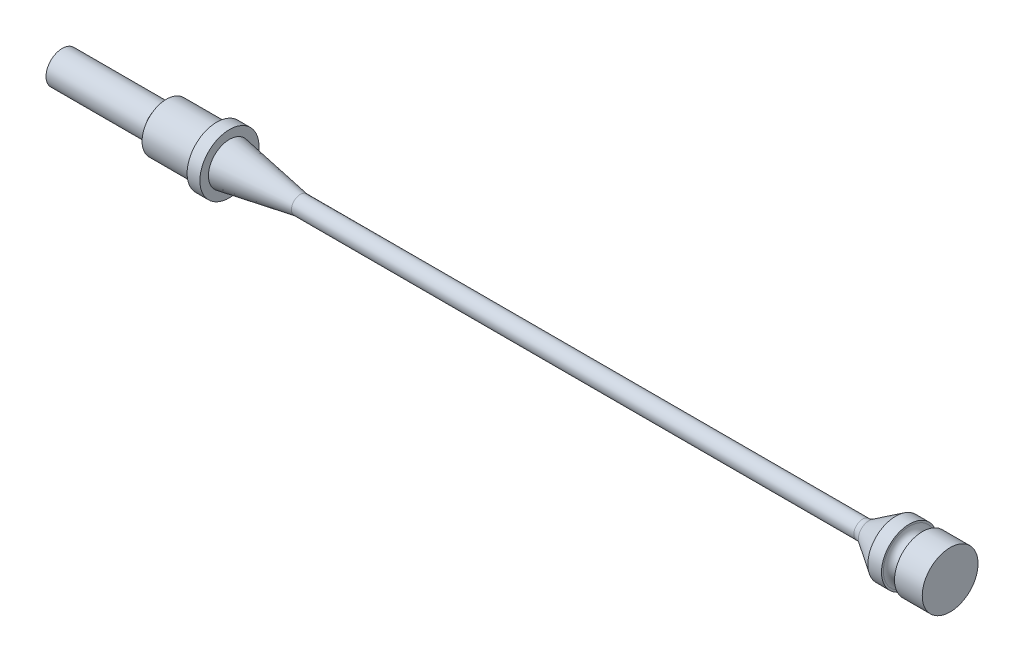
ISO-10303-21;
HEADER;
FILE_DESCRIPTION(('STEP AP214'),'2;1');
FILE_NAME('part.step','',(''),(''),'','','');
FILE_SCHEMA(('AUTOMOTIVE_DESIGN { 1 0 10303 214 1 1 1 1 }'));
ENDSEC;
DATA;
#1=APPLICATION_CONTEXT('core data for automotive mechanical design processes');
#2=APPLICATION_PROTOCOL_DEFINITION('international standard','automotive_design',2000,#1);
#3=PRODUCT_CONTEXT('',#1,'mechanical');
#4=PRODUCT('Part','Part','',(#3));
#5=PRODUCT_RELATED_PRODUCT_CATEGORY('part','',(#4));
#6=PRODUCT_DEFINITION_FORMATION('','',#4);
#7=PRODUCT_DEFINITION_CONTEXT('part definition',#1,'design');
#8=PRODUCT_DEFINITION('design','',#6,#7);
#9=PRODUCT_DEFINITION_SHAPE('','',#8);
#10=(LENGTH_UNIT() NAMED_UNIT(*) SI_UNIT(.MILLI.,.METRE.));
#11=(NAMED_UNIT(*) PLANE_ANGLE_UNIT() SI_UNIT($,.RADIAN.));
#12=(NAMED_UNIT(*) SI_UNIT($,.STERADIAN.) SOLID_ANGLE_UNIT());
#13=UNCERTAINTY_MEASURE_WITH_UNIT(LENGTH_MEASURE(1.E-05),#10,'distance_accuracy_value','');
#14=(GEOMETRIC_REPRESENTATION_CONTEXT(3) GLOBAL_UNCERTAINTY_ASSIGNED_CONTEXT((#13)) GLOBAL_UNIT_ASSIGNED_CONTEXT((#10,
#11,#12)) REPRESENTATION_CONTEXT('',''));
#15=CARTESIAN_POINT('',(0.,0.,0.));
#16=DIRECTION('',(0.,0.,1.));
#17=DIRECTION('',(1.,0.,0.));
#18=AXIS2_PLACEMENT_3D('',#15,#16,#17);
#19=CARTESIAN_POINT('',(190.5,0.,0.));
#20=DIRECTION('',(-1.,0.,0.));
#21=DIRECTION('',(0.,0.,1.));
#22=AXIS2_PLACEMENT_3D('',#19,#20,#21);
#23=PLANE('',#22);
#24=CARTESIAN_POINT('',(190.5,0.,0.));
#25=DIRECTION('',(-1.,0.,0.));
#26=DIRECTION('',(0.,0.,1.));
#27=AXIS2_PLACEMENT_3D('',#24,#25,#26);
#28=CIRCLE('',#27,5.98805);
#29=CARTESIAN_POINT('',(190.5,0.,5.98805));
#30=VERTEX_POINT('',#29);
#31=EDGE_CURVE('E10',#30,#30,#28,.T.);
#32=ORIENTED_EDGE('',*,*,#31,.F.);
#33=EDGE_LOOP('',(#32));
#34=FACE_BOUND('',#33,.T.);
#35=ADVANCED_FACE('F30',(#34),#23,.F.);
#36=CARTESIAN_POINT('',(0.,0.,0.));
#37=DIRECTION('',(-1.,0.,0.));
#38=DIRECTION('',(0.,0.,1.));
#39=AXIS2_PLACEMENT_3D('',#36,#37,#38);
#40=CYLINDRICAL_SURFACE('',#39,5.98805);
#41=CARTESIAN_POINT('',(184.5564,0.,0.));
#42=DIRECTION('',(-1.,0.,0.));
#43=DIRECTION('',(0.,0.,1.));
#44=AXIS2_PLACEMENT_3D('',#41,#42,#43);
#45=CIRCLE('',#44,5.98805);
#46=CARTESIAN_POINT('',(184.5564,0.,5.98805));
#47=VERTEX_POINT('',#46);
#48=EDGE_CURVE('E36',#47,#47,#45,.T.);
#49=ORIENTED_EDGE('',*,*,#48,.F.);
#50=EDGE_LOOP('',(#49));
#51=FACE_BOUND('',#50,.T.);
#52=ORIENTED_EDGE('',*,*,#31,.T.);
#53=EDGE_LOOP('',(#52));
#54=FACE_BOUND('',#53,.T.);
#55=ADVANCED_FACE('F168',(#51,#54),#40,.T.);
#56=CARTESIAN_POINT('',(184.5564,5.98805,0.));
#57=DIRECTION('',(1.,0.,0.));
#58=DIRECTION('',(0.,0.,-1.));
#59=AXIS2_PLACEMENT_3D('',#56,#57,#58);
#60=PLANE('',#59);
#61=CARTESIAN_POINT('',(184.5564,0.,0.));
#62=DIRECTION('',(-1.,0.,0.));
#63=DIRECTION('',(0.,0.,1.));
#64=AXIS2_PLACEMENT_3D('',#61,#62,#63);
#65=CIRCLE('',#64,5.588);
#66=CARTESIAN_POINT('',(184.5564,0.,5.588));
#67=VERTEX_POINT('',#66);
#68=EDGE_CURVE('E40',#67,#67,#65,.T.);
#69=ORIENTED_EDGE('',*,*,#68,.F.);
#70=EDGE_LOOP('',(#69));
#71=FACE_BOUND('',#70,.T.);
#72=ORIENTED_EDGE('',*,*,#48,.T.);
#73=EDGE_LOOP('',(#72));
#74=FACE_BOUND('',#73,.T.);
#75=ADVANCED_FACE('F163',(#71,#74),#60,.F.);
#76=CARTESIAN_POINT('',(183.1594,0.,0.));
#77=DIRECTION('',(-1.,0.,0.));
#78=DIRECTION('',(0.,0.,1.));
#79=AXIS2_PLACEMENT_3D('',#76,#77,#78);
#80=TOROIDAL_SURFACE('',#79,5.588,1.397);
#81=CARTESIAN_POINT('',(181.7624,0.,0.));
#82=DIRECTION('',(-1.,0.,0.));
#83=DIRECTION('',(0.,0.,1.));
#84=AXIS2_PLACEMENT_3D('',#81,#82,#83);
#85=CIRCLE('',#84,5.588);
#86=CARTESIAN_POINT('',(181.7624,0.,5.588));
#87=VERTEX_POINT('',#86);
#88=EDGE_CURVE('E44',#87,#87,#85,.T.);
#89=ORIENTED_EDGE('',*,*,#88,.F.);
#90=EDGE_LOOP('',(#89));
#91=FACE_BOUND('',#90,.T.);
#92=ORIENTED_EDGE('',*,*,#68,.T.);
#93=EDGE_LOOP('',(#92));
#94=FACE_BOUND('',#93,.T.);
#95=ADVANCED_FACE('F157',(#91,#94),#80,.F.);
#96=CARTESIAN_POINT('',(181.7624,5.588,0.));
#97=DIRECTION('',(-1.,0.,0.));
#98=DIRECTION('',(0.,0.,1.));
#99=AXIS2_PLACEMENT_3D('',#96,#97,#98);
#100=PLANE('',#99);
#101=CARTESIAN_POINT('',(181.7624,0.,0.));
#102=DIRECTION('',(-1.,0.,0.));
#103=DIRECTION('',(0.,0.,1.));
#104=AXIS2_PLACEMENT_3D('',#101,#102,#103);
#105=CIRCLE('',#104,5.98805);
#106=CARTESIAN_POINT('',(181.7624,0.,5.98805));
#107=VERTEX_POINT('',#106);
#108=EDGE_CURVE('E49',#107,#107,#105,.T.);
#109=ORIENTED_EDGE('',*,*,#108,.F.);
#110=EDGE_LOOP('',(#109));
#111=FACE_BOUND('',#110,.T.);
#112=ORIENTED_EDGE('',*,*,#88,.T.);
#113=EDGE_LOOP('',(#112));
#114=FACE_BOUND('',#113,.T.);
#115=ADVANCED_FACE('F151',(#111,#114),#100,.F.);
#116=CARTESIAN_POINT('',(0.,0.,0.));
#117=DIRECTION('',(-1.,0.,0.));
#118=DIRECTION('',(0.,0.,1.));
#119=AXIS2_PLACEMENT_3D('',#116,#117,#118);
#120=CYLINDRICAL_SURFACE('',#119,5.98805);
#121=CARTESIAN_POINT('',(178.8287,0.,0.));
#122=DIRECTION('',(-1.,0.,0.));
#123=DIRECTION('',(0.,0.,1.));
#124=AXIS2_PLACEMENT_3D('',#121,#122,#123);
#125=CIRCLE('',#124,5.98805);
#126=CARTESIAN_POINT('',(178.8287,0.,5.98805));
#127=VERTEX_POINT('',#126);
#128=EDGE_CURVE('E52',#127,#127,#125,.T.);
#129=ORIENTED_EDGE('',*,*,#128,.F.);
#130=EDGE_LOOP('',(#129));
#131=FACE_BOUND('',#130,.T.);
#132=ORIENTED_EDGE('',*,*,#108,.T.);
#133=EDGE_LOOP('',(#132));
#134=FACE_BOUND('',#133,.T.);
#135=ADVANCED_FACE('F145',(#131,#134),#120,.T.);
#136=CARTESIAN_POINT('',(178.8287,0.,0.));
#137=DIRECTION('',(1.,0.,0.));
#138=DIRECTION('',(0.,0.,-1.));
#139=AXIS2_PLACEMENT_3D('',#136,#137,#138);
#140=CONICAL_SURFACE('',#139,5.98805,0.571438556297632);
#141=CARTESIAN_POINT('',(173.106298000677,0.,0.));
#142=DIRECTION('',(-1.,0.,0.));
#143=DIRECTION('',(0.,0.,1.));
#144=AXIS2_PLACEMENT_3D('',#141,#142,#143);
#145=CIRCLE('',#144,2.30854551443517);
#146=CARTESIAN_POINT('',(173.106298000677,0.,2.30854551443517));
#147=VERTEX_POINT('',#146);
#148=EDGE_CURVE('E55',#147,#147,#145,.T.);
#149=ORIENTED_EDGE('',*,*,#148,.F.);
#150=EDGE_LOOP('',(#149));
#151=FACE_BOUND('',#150,.T.);
#152=ORIENTED_EDGE('',*,*,#128,.T.);
#153=EDGE_LOOP('',(#152));
#154=FACE_BOUND('',#153,.T.);
#155=ADVANCED_FACE('F139',(#151,#154),#140,.T.);
#156=CARTESIAN_POINT('',(171.732557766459,0.,0.));
#157=DIRECTION('',(-1.,0.,0.));
#158=DIRECTION('',(0.,0.,1.));
#159=AXIS2_PLACEMENT_3D('',#156,#157,#158);
#160=TOROIDAL_SURFACE('',#159,4.445,2.54000000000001);
#161=CARTESIAN_POINT('',(171.732557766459,0.,0.));
#162=DIRECTION('',(-1.,0.,0.));
#163=DIRECTION('',(0.,0.,1.));
#164=AXIS2_PLACEMENT_3D('',#161,#162,#163);
#165=CIRCLE('',#164,1.905);
#166=CARTESIAN_POINT('',(171.732557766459,0.,1.905));
#167=VERTEX_POINT('',#166);
#168=EDGE_CURVE('E58',#167,#167,#165,.T.);
#169=ORIENTED_EDGE('',*,*,#168,.F.);
#170=EDGE_LOOP('',(#169));
#171=FACE_BOUND('',#170,.T.);
#172=ORIENTED_EDGE('',*,*,#148,.T.);
#173=EDGE_LOOP('',(#172));
#174=FACE_BOUND('',#173,.T.);
#175=ADVANCED_FACE('F133',(#171,#174),#160,.F.);
#176=CARTESIAN_POINT('',(0.,0.,0.));
#177=DIRECTION('',(-1.,0.,0.));
#178=DIRECTION('',(0.,0.,1.));
#179=AXIS2_PLACEMENT_3D('',#176,#177,#178);
#180=CYLINDRICAL_SURFACE('',#179,1.90499999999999);
#181=CARTESIAN_POINT('',(51.0825577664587,0.,0.));
#182=DIRECTION('',(-1.,0.,0.));
#183=DIRECTION('',(0.,0.,1.));
#184=AXIS2_PLACEMENT_3D('',#181,#182,#183);
#185=CIRCLE('',#184,1.90499999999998);
#186=CARTESIAN_POINT('',(51.0825577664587,0.,1.90499999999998));
#187=VERTEX_POINT('',#186);
#188=EDGE_CURVE('E61',#187,#187,#185,.T.);
#189=ORIENTED_EDGE('',*,*,#188,.F.);
#190=EDGE_LOOP('',(#189));
#191=FACE_BOUND('',#190,.T.);
#192=ORIENTED_EDGE('',*,*,#168,.T.);
#193=EDGE_LOOP('',(#192));
#194=FACE_BOUND('',#193,.T.);
#195=ADVANCED_FACE('F127',(#191,#194),#180,.T.);
#196=CARTESIAN_POINT('',(51.0825577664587,0.,0.));
#197=DIRECTION('',(-1.,0.,0.));
#198=DIRECTION('',(0.,0.,1.));
#199=AXIS2_PLACEMENT_3D('',#196,#197,#198);
#200=CONICAL_SURFACE('',#199,1.90499999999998,0.169987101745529);
#201=CARTESIAN_POINT('',(35.8775,0.,0.));
#202=DIRECTION('',(-1.,0.,0.));
#203=DIRECTION('',(0.,0.,1.));
#204=AXIS2_PLACEMENT_3D('',#201,#202,#203);
#205=CIRCLE('',#204,4.51485);
#206=CARTESIAN_POINT('',(35.8775,0.,4.51485));
#207=VERTEX_POINT('',#206);
#208=EDGE_CURVE('E64',#207,#207,#205,.T.);
#209=ORIENTED_EDGE('',*,*,#208,.F.);
#210=EDGE_LOOP('',(#209));
#211=FACE_BOUND('',#210,.T.);
#212=ORIENTED_EDGE('',*,*,#188,.T.);
#213=EDGE_LOOP('',(#212));
#214=FACE_BOUND('',#213,.T.);
#215=ADVANCED_FACE('F121',(#211,#214),#200,.T.);
#216=CARTESIAN_POINT('',(35.8775,6.35,0.));
#217=DIRECTION('',(-1.,0.,0.));
#218=DIRECTION('',(0.,0.,1.));
#219=AXIS2_PLACEMENT_3D('',#216,#217,#218);
#220=PLANE('',#219);
#221=CARTESIAN_POINT('',(35.8775,0.,0.));
#222=DIRECTION('',(-1.,0.,0.));
#223=DIRECTION('',(0.,0.,1.));
#224=AXIS2_PLACEMENT_3D('',#221,#222,#223);
#225=CIRCLE('',#224,6.35);
#226=CARTESIAN_POINT('',(35.8775,0.,6.35));
#227=VERTEX_POINT('',#226);
#228=EDGE_CURVE('E67',#227,#227,#225,.T.);
#229=ORIENTED_EDGE('',*,*,#228,.F.);
#230=EDGE_LOOP('',(#229));
#231=FACE_BOUND('',#230,.T.);
#232=ORIENTED_EDGE('',*,*,#208,.T.);
#233=EDGE_LOOP('',(#232));
#234=FACE_BOUND('',#233,.T.);
#235=ADVANCED_FACE('F115',(#231,#234),#220,.F.);
#236=CARTESIAN_POINT('',(0.,0.,0.));
#237=DIRECTION('',(-1.,0.,0.));
#238=DIRECTION('',(0.,0.,1.));
#239=AXIS2_PLACEMENT_3D('',#236,#237,#238);
#240=CYLINDRICAL_SURFACE('',#239,6.35);
#241=CARTESIAN_POINT('',(33.1343,0.,0.));
#242=DIRECTION('',(-1.,0.,0.));
#243=DIRECTION('',(0.,0.,1.));
#244=AXIS2_PLACEMENT_3D('',#241,#242,#243);
#245=CIRCLE('',#244,6.35);
#246=CARTESIAN_POINT('',(33.1343,0.,6.35));
#247=VERTEX_POINT('',#246);
#248=EDGE_CURVE('E70',#247,#247,#245,.T.);
#249=ORIENTED_EDGE('',*,*,#248,.F.);
#250=EDGE_LOOP('',(#249));
#251=FACE_BOUND('',#250,.T.);
#252=ORIENTED_EDGE('',*,*,#228,.T.);
#253=EDGE_LOOP('',(#252));
#254=FACE_BOUND('',#253,.T.);
#255=ADVANCED_FACE('F109',(#251,#254),#240,.T.);
#256=CARTESIAN_POINT('',(33.1343,5.22605,0.));
#257=DIRECTION('',(1.,0.,0.));
#258=DIRECTION('',(0.,0.,-1.));
#259=AXIS2_PLACEMENT_3D('',#256,#257,#258);
#260=PLANE('',#259);
#261=CARTESIAN_POINT('',(33.1343,0.,0.));
#262=DIRECTION('',(-1.,0.,0.));
#263=DIRECTION('',(0.,0.,1.));
#264=AXIS2_PLACEMENT_3D('',#261,#262,#263);
#265=CIRCLE('',#264,5.22605);
#266=CARTESIAN_POINT('',(33.1343,0.,5.22605));
#267=VERTEX_POINT('',#266);
#268=EDGE_CURVE('E73',#267,#267,#265,.T.);
#269=ORIENTED_EDGE('',*,*,#268,.F.);
#270=EDGE_LOOP('',(#269));
#271=FACE_BOUND('',#270,.T.);
#272=ORIENTED_EDGE('',*,*,#248,.T.);
#273=EDGE_LOOP('',(#272));
#274=FACE_BOUND('',#273,.T.);
#275=ADVANCED_FACE('F103',(#271,#274),#260,.F.);
#276=CARTESIAN_POINT('',(0.,0.,0.));
#277=DIRECTION('',(-1.,0.,0.));
#278=DIRECTION('',(0.,0.,1.));
#279=AXIS2_PLACEMENT_3D('',#276,#277,#278);
#280=CYLINDRICAL_SURFACE('',#279,5.22605);
#281=CARTESIAN_POINT('',(22.352,0.,0.));
#282=DIRECTION('',(-1.,0.,0.));
#283=DIRECTION('',(0.,0.,1.));
#284=AXIS2_PLACEMENT_3D('',#281,#282,#283);
#285=CIRCLE('',#284,5.22605);
#286=CARTESIAN_POINT('',(22.352,0.,5.22605));
#287=VERTEX_POINT('',#286);
#288=EDGE_CURVE('E76',#287,#287,#285,.T.);
#289=ORIENTED_EDGE('',*,*,#288,.F.);
#290=EDGE_LOOP('',(#289));
#291=FACE_BOUND('',#290,.T.);
#292=ORIENTED_EDGE('',*,*,#268,.T.);
#293=EDGE_LOOP('',(#292));
#294=FACE_BOUND('',#293,.T.);
#295=ADVANCED_FACE('F97',(#291,#294),#280,.T.);
#296=CARTESIAN_POINT('',(22.352,0.,0.));
#297=DIRECTION('',(1.,0.,0.));
#298=DIRECTION('',(0.,0.,-1.));
#299=AXIS2_PLACEMENT_3D('',#296,#297,#298);
#300=CONICAL_SURFACE('',#299,5.22605,0.940266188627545);
#301=CARTESIAN_POINT('',(21.082,0.,0.));
#302=DIRECTION('',(-1.,0.,0.));
#303=DIRECTION('',(0.,0.,1.));
#304=AXIS2_PLACEMENT_3D('',#301,#302,#303);
#305=CIRCLE('',#304,3.48615);
#306=CARTESIAN_POINT('',(21.082,0.,3.48615));
#307=VERTEX_POINT('',#306);
#308=EDGE_CURVE('E79',#307,#307,#305,.T.);
#309=ORIENTED_EDGE('',*,*,#308,.F.);
#310=EDGE_LOOP('',(#309));
#311=FACE_BOUND('',#310,.T.);
#312=ORIENTED_EDGE('',*,*,#288,.T.);
#313=EDGE_LOOP('',(#312));
#314=FACE_BOUND('',#313,.T.);
#315=ADVANCED_FACE('F91',(#311,#314),#300,.T.);
#316=CARTESIAN_POINT('',(0.,0.,0.));
#317=DIRECTION('',(-1.,0.,0.));
#318=DIRECTION('',(0.,0.,1.));
#319=AXIS2_PLACEMENT_3D('',#316,#317,#318);
#320=CYLINDRICAL_SURFACE('',#319,3.48615);
#321=CARTESIAN_POINT('',(0.,0.,0.));
#322=DIRECTION('',(-1.,0.,0.));
#323=DIRECTION('',(0.,0.,1.));
#324=AXIS2_PLACEMENT_3D('',#321,#322,#323);
#325=CIRCLE('',#324,3.48615);
#326=CARTESIAN_POINT('',(0.,0.,3.48615));
#327=VERTEX_POINT('',#326);
#328=EDGE_CURVE('E82',#327,#327,#325,.T.);
#329=ORIENTED_EDGE('',*,*,#328,.F.);
#330=EDGE_LOOP('',(#329));
#331=FACE_BOUND('',#330,.T.);
#332=ORIENTED_EDGE('',*,*,#308,.T.);
#333=EDGE_LOOP('',(#332));
#334=FACE_BOUND('',#333,.T.);
#335=ADVANCED_FACE('F88',(#331,#334),#320,.T.);
#336=CARTESIAN_POINT('',(0.,0.,0.));
#337=DIRECTION('',(1.,0.,0.));
#338=DIRECTION('',(0.,0.,-1.));
#339=AXIS2_PLACEMENT_3D('',#336,#337,#338);
#340=PLANE('',#339);
#341=ORIENTED_EDGE('',*,*,#328,.T.);
#342=EDGE_LOOP('',(#341));
#343=FACE_BOUND('',#342,.T.);
#344=ADVANCED_FACE('F86',(#343),#340,.F.);
#345=CLOSED_SHELL('',(#35,#55,#75,#95,#115,#135,#155,#175,#195,#215,#235,#255,#275,#295,#315,
#335,#344));
#346=MANIFOLD_SOLID_BREP('B2',#345);
#347=ADVANCED_BREP_SHAPE_REPRESENTATION('',(#18,#346),#14);
#348=SHAPE_DEFINITION_REPRESENTATION(#9,#347);
ENDSEC;
END-ISO-10303-21;
